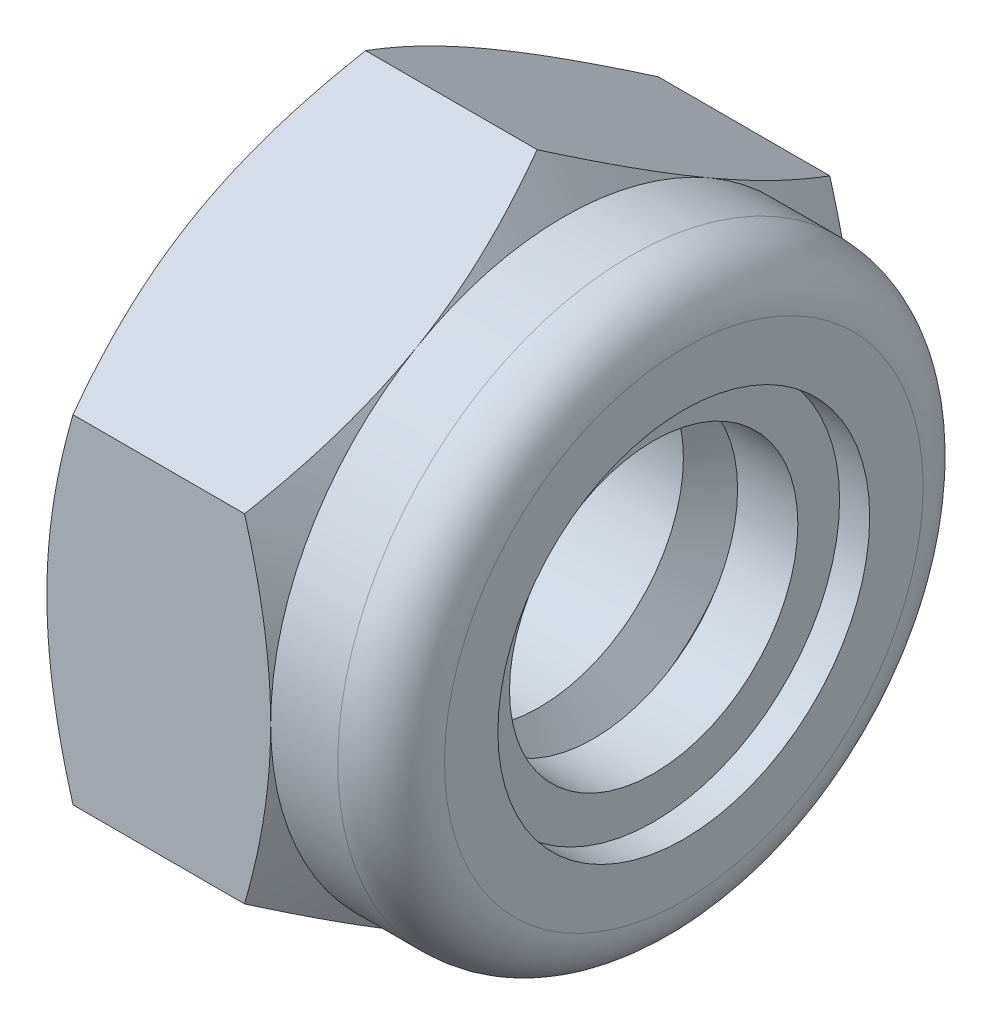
ISO-10303-21;
HEADER;
FILE_DESCRIPTION(('STEP AP214'),'2;1');
FILE_NAME('part.step','',(''),(''),'','','');
FILE_SCHEMA(('AUTOMOTIVE_DESIGN { 1 0 10303 214 1 1 1 1 }'));
ENDSEC;
DATA;
#1=APPLICATION_CONTEXT('core data for automotive mechanical design processes');
#2=APPLICATION_PROTOCOL_DEFINITION('international standard','automotive_design',2000,#1);
#3=PRODUCT_CONTEXT('',#1,'mechanical');
#4=PRODUCT('Part','Part','',(#3));
#5=PRODUCT_RELATED_PRODUCT_CATEGORY('part','',(#4));
#6=PRODUCT_DEFINITION_FORMATION('','',#4);
#7=PRODUCT_DEFINITION_CONTEXT('part definition',#1,'design');
#8=PRODUCT_DEFINITION('design','',#6,#7);
#9=PRODUCT_DEFINITION_SHAPE('','',#8);
#10=(LENGTH_UNIT() NAMED_UNIT(*) SI_UNIT(.MILLI.,.METRE.));
#11=(NAMED_UNIT(*) PLANE_ANGLE_UNIT() SI_UNIT($,.RADIAN.));
#12=(NAMED_UNIT(*) SI_UNIT($,.STERADIAN.) SOLID_ANGLE_UNIT());
#13=UNCERTAINTY_MEASURE_WITH_UNIT(LENGTH_MEASURE(1.E-05),#10,'distance_accuracy_value','');
#14=(GEOMETRIC_REPRESENTATION_CONTEXT(3) GLOBAL_UNCERTAINTY_ASSIGNED_CONTEXT((#13)) GLOBAL_UNIT_ASSIGNED_CONTEXT((#10,
#11,#12)) REPRESENTATION_CONTEXT('',''));
#15=CARTESIAN_POINT('',(0.,0.,0.));
#16=DIRECTION('',(0.,0.,1.));
#17=DIRECTION('',(1.,0.,0.));
#18=AXIS2_PLACEMENT_3D('',#15,#16,#17);
#19=CARTESIAN_POINT('',(6.5,0.,0.));
#20=DIRECTION('',(-1.,0.,0.));
#21=DIRECTION('',(0.,-1.,0.));
#22=AXIS2_PLACEMENT_3D('',#19,#20,#21);
#23=CONICAL_SURFACE('',#22,8.5,1.0471975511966);
#24=CARTESIAN_POINT('',(5.74074395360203,-9.81507004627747,0.0002));
#25=CARTESIAN_POINT('',(5.80301386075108,-9.70719836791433,-0.186639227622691));
#26=CARTESIAN_POINT('',(5.86245770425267,-9.59892450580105,-0.374175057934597));
#27=CARTESIAN_POINT('',(5.97491488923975,-9.3814974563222,-0.750769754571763));
#28=CARTESIAN_POINT('',(6.02792545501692,-9.27234391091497,-0.939829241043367));
#29=CARTESIAN_POINT('',(6.17626661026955,-8.94313560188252,-1.5100347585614));
#30=CARTESIAN_POINT('',(6.26064107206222,-8.72178130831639,-1.89343164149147));
#31=CARTESIAN_POINT('',(6.35957998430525,-8.39052888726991,-2.46717766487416));
#32=CARTESIAN_POINT('',(6.38776480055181,-8.28162036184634,-2.65581276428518));
#33=CARTESIAN_POINT('',(6.4350259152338,-8.06331079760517,-3.03393602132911));
#34=CARTESIAN_POINT('',(6.45410301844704,-7.95390980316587,-3.22342410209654));
#35=CARTESIAN_POINT('',(6.4826652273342,-7.73491944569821,-3.6027265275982));
#36=CARTESIAN_POINT('',(6.49216121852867,-7.62533043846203,-3.79254025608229));
#37=CARTESIAN_POINT('',(6.50135762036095,-7.40605119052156,-4.17234305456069));
#38=CARTESIAN_POINT('',(6.50105833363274,-7.29636095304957,-4.36233211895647));
#39=CARTESIAN_POINT('',(6.49134552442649,-7.09129139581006,-4.71752301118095));
#40=CARTESIAN_POINT('',(6.48311683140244,-6.99589760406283,-4.8827499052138));
#41=CARTESIAN_POINT('',(6.4594107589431,-6.80533344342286,-5.21281671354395));
#42=CARTESIAN_POINT('',(6.4439328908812,-6.71016309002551,-5.37765660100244));
#43=CARTESIAN_POINT('',(6.38699137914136,-6.42502047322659,-5.87153810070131));
#44=CARTESIAN_POINT('',(6.33502693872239,-6.23555293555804,-6.19970550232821));
#45=CARTESIAN_POINT('',(6.20511505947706,-5.8546080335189,-6.85952142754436));
#46=CARTESIAN_POINT('',(6.12661693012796,-5.66317928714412,-7.19108574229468));
#47=CARTESIAN_POINT('',(5.94845866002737,-5.28317649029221,-7.84926989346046));
#48=CARTESIAN_POINT('',(5.84884036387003,-5.09459757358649,-8.17589815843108));
#49=CARTESIAN_POINT('',(5.74074395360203,-4.90736181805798,-8.5002));
#50=B_SPLINE_CURVE_WITH_KNOTS('',3,(#24,#25,#26,#27,#28,#29,#30,#31,#32,#33,#34,#35,#36,#37,#38,
#39,#40,#41,#42,#43,#44,#45,#46,#47,#48,#49),.UNSPECIFIED.,.F.,.F.,(4,2,2,2,2,2,2,2,2,2,2,2,4),
(0.,0.673596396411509,1.34748239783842,2.69805431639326,3.356799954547,4.01548737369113,
4.67342558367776,5.33134346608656,5.9040955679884,6.47688628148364,7.62328361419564,
8.79510569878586,9.9646274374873),.UNSPECIFIED.);
#51=CARTESIAN_POINT('',(6.5,-7.36121593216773,-4.25));
#52=VERTEX_POINT('',#51);
#53=CARTESIAN_POINT('',(5.74081062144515,-4.90747728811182,-8.5));
#54=VERTEX_POINT('',#53);
#55=EDGE_CURVE('E231',#52,#54,#50,.T.);
#56=ORIENTED_EDGE('',*,*,#55,.T.);
#57=CARTESIAN_POINT('',(2.31788839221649,-13.2518632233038,-8.5));
#58=CARTESIAN_POINT('',(2.49854013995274,-12.8800303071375,-8.5));
#59=CARTESIAN_POINT('',(2.67747984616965,-12.5073513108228,-8.5));
#60=CARTESIAN_POINT('',(3.03097371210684,-11.7598514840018,-8.5));
#61=CARTESIAN_POINT('',(3.20552719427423,-11.3850303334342,-8.5));
#62=CARTESIAN_POINT('',(3.55015048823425,-10.6308985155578,-8.5));
#63=CARTESIAN_POINT('',(3.72019131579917,-10.25157455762,-8.5));
#64=CARTESIAN_POINT('',(4.05340731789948,-9.48993414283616,-8.5));
#65=CARTESIAN_POINT('',(4.21658281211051,-9.10761782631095,-8.5));
#66=CARTESIAN_POINT('',(4.53947883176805,-8.32675890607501,-8.5));
#67=CARTESIAN_POINT('',(4.69890971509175,-7.92809587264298,-8.5));
#68=CARTESIAN_POINT('',(5.00587335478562,-7.12613246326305,-8.5));
#69=CARTESIAN_POINT('',(5.15340478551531,-6.72283157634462,-8.5));
#70=CARTESIAN_POINT('',(5.43274708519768,-5.91167859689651,-8.5));
#71=CARTESIAN_POINT('',(5.56458918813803,-5.50383737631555,-8.5));
#72=CARTESIAN_POINT('',(5.80836985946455,-4.68231916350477,-8.5));
#73=CARTESIAN_POINT('',(5.92031462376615,-4.26864403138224,-8.5));
#74=CARTESIAN_POINT('',(6.11836559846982,-3.43747532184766,-8.5));
#75=CARTESIAN_POINT('',(6.2046151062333,-3.02001682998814,-8.5));
#76=CARTESIAN_POINT('',(6.31102233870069,-2.3899721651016,-8.5));
#77=CARTESIAN_POINT('',(6.34266500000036,-2.17929945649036,-8.5));
#78=CARTESIAN_POINT('',(6.3976756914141,-1.75688331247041,-8.5));
#79=CARTESIAN_POINT('',(6.42104452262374,-1.54513998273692,-8.5));
#80=CARTESIAN_POINT('',(6.45874523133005,-1.1236627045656,-8.5));
#81=CARTESIAN_POINT('',(6.47319225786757,-0.913939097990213,-8.5));
#82=CARTESIAN_POINT('',(6.49320090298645,-0.494068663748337,-8.5));
#83=CARTESIAN_POINT('',(6.49876267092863,-0.283921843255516,-8.5));
#84=CARTESIAN_POINT('',(6.50086787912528,0.13641856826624,-8.5));
#85=CARTESIAN_POINT('',(6.49741131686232,0.346612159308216,-8.5));
#86=CARTESIAN_POINT('',(6.48156532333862,0.766664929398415,-8.5));
#87=CARTESIAN_POINT('',(6.46917545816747,0.97652409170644,-8.5));
#88=CARTESIAN_POINT('',(6.42909597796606,1.47878774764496,-8.5));
#89=CARTESIAN_POINT('',(6.39728403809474,1.77087042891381,-8.5));
#90=CARTESIAN_POINT('',(6.31807515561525,2.3528997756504,-8.5));
#91=CARTESIAN_POINT('',(6.27067615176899,2.64284615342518,-8.5));
#92=CARTESIAN_POINT('',(6.1076091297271,3.50913253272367,-8.5));
#93=CARTESIAN_POINT('',(5.9710997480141,4.08160312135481,-8.5));
#94=CARTESIAN_POINT('',(5.73397394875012,4.93766696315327,-8.5));
#95=CARTESIAN_POINT('',(5.64842697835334,5.22569021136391,-8.5));
#96=CARTESIAN_POINT('',(5.46834426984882,5.79894037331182,-8.5));
#97=CARTESIAN_POINT('',(5.3738084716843,6.08416726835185,-8.5));
#98=CARTESIAN_POINT('',(5.17727344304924,6.65191211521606,-8.5));
#99=CARTESIAN_POINT('',(5.07527660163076,6.93443090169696,-8.5));
#100=CARTESIAN_POINT('',(4.86502984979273,7.49712109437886,-8.5));
#101=CARTESIAN_POINT('',(4.75678001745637,7.77729252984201,-8.5));
#102=CARTESIAN_POINT('',(4.49155299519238,8.44510102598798,-8.5));
#103=CARTESIAN_POINT('',(4.33212472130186,8.83176288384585,-8.5));
#104=CARTESIAN_POINT('',(4.00533416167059,9.60172958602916,-8.5));
#105=CARTESIAN_POINT('',(3.83797135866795,9.98503420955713,-8.5));
#106=CARTESIAN_POINT('',(3.49692161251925,10.7489215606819,-8.5));
#107=CARTESIAN_POINT('',(3.32323316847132,11.1295036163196,-8.5));
#108=CARTESIAN_POINT('',(2.97082583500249,11.8883149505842,-8.5));
#109=CARTESIAN_POINT('',(2.79210705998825,12.2665442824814,-8.5));
#110=CARTESIAN_POINT('',(2.4303856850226,13.0214793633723,-8.5));
#111=CARTESIAN_POINT('',(2.24737840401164,13.3981828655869,-8.5));
#112=CARTESIAN_POINT('',(1.87801360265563,14.1499431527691,-8.5));
#113=CARTESIAN_POINT('',(1.69165606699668,14.5249999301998,-8.5));
#114=CARTESIAN_POINT('',(1.12851086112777,15.647996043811,-8.5));
#115=CARTESIAN_POINT('',(0.747599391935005,16.3938671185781,-8.5));
#116=CARTESIAN_POINT('',(0.0110494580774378,17.817867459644,-8.5));
#117=CARTESIAN_POINT('',(-0.343957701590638,18.4963247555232,-8.5));
#118=CARTESIAN_POINT('',(-1.05881736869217,19.8507127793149,-8.5));
#119=CARTESIAN_POINT('',(-1.41867005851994,20.5266434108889,-8.5));
#120=CARTESIAN_POINT('',(-2.1411145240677,21.8747786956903,-8.5));
#121=CARTESIAN_POINT('',(-2.50369676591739,22.5469884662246,-8.5));
#122=CARTESIAN_POINT('',(-3.23174260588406,23.8897963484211,-8.5));
#123=CARTESIAN_POINT('',(-3.59720603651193,24.5603945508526,-8.5));
#124=CARTESIAN_POINT('',(-3.96374232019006,25.2304018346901,-8.5));
#125=B_SPLINE_CURVE_WITH_KNOTS('',3,(#57,#58,#59,#60,#61,#62,#63,#64,#65,#66,#67,#68,#69,#70,
#71,#72,#73,#74,#75,#76,#77,#78,#79,#80,#81,#82,#83,#84,#85,#86,#87,#88,#89,#90,#91,#92,#93,#94,
#95,#96,#97,#98,#99,#100,#101,#102,#103,#104,#105,#106,#107,#108,#109,#110,#111,#112,#113,#114,
#115,#116,#117,#118,#119,#120,#121,#122,#123,#124),.UNSPECIFIED.,.F.,.F.,(4,2,2,2,2,2,2,2,2,2,2,
2,2,2,2,2,2,2,2,2,2,2,2,2,2,2,2,2,2,2,2,2,2,4),(0.,1.24019742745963,2.48058526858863,
3.72760926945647,4.97457513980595,6.26250912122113,7.55058638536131,8.83605488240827,
10.1211223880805,11.3988830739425,12.0378535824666,12.6767622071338,13.3072423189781,
13.9377118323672,14.5681815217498,15.1986818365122,16.0796153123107,16.9606653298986,
18.7237149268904,19.625015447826,20.5263219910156,21.4273411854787,22.3283491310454,
23.5829490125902,24.8376307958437,26.0926122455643,27.3475651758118,28.603958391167,
29.8603573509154,32.3728022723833,34.6699557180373,36.967195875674,39.2584733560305,
41.5496186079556),.UNSPECIFIED.);
#126=CARTESIAN_POINT('',(6.5,0.,-8.5));
#127=VERTEX_POINT('',#126);
#128=EDGE_CURVE('E229',#54,#127,#125,.T.);
#129=ORIENTED_EDGE('',*,*,#128,.T.);
#130=CARTESIAN_POINT('',(6.5,0.,0.));
#131=DIRECTION('',(1.,0.,0.));
#132=DIRECTION('',(0.,1.,0.));
#133=AXIS2_PLACEMENT_3D('',#130,#131,#132);
#134=CIRCLE('',#133,8.5);
#135=EDGE_CURVE('E298',#52,#127,#134,.T.);
#136=ORIENTED_EDGE('',*,*,#135,.F.);
#137=EDGE_LOOP('',(#56,#129,#136));
#138=FACE_BOUND('',#137,.T.);
#139=ADVANCED_FACE('F30',(#138),#23,.T.);
#140=CARTESIAN_POINT('',(6.5,7.36121593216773,-4.25));
#141=VERTEX_POINT('',#140);
#142=EDGE_CURVE('E367',#127,#141,#134,.T.);
#143=ORIENTED_EDGE('',*,*,#142,.F.);
#144=CARTESIAN_POINT('',(5.74081062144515,4.90747728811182,-8.5));
#145=VERTEX_POINT('',#144);
#146=EDGE_CURVE('E223',#127,#145,#125,.T.);
#147=ORIENTED_EDGE('',*,*,#146,.T.);
#148=CARTESIAN_POINT('',(5.74074395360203,4.90736181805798,-8.5002));
#149=CARTESIAN_POINT('',(5.80301386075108,5.01523349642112,-8.31336077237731));
#150=CARTESIAN_POINT('',(5.86245770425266,5.1235073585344,-8.1258249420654));
#151=CARTESIAN_POINT('',(5.97491488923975,5.34093440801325,-7.74923024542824));
#152=CARTESIAN_POINT('',(6.02792545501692,5.45008795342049,-7.56017075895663));
#153=CARTESIAN_POINT('',(6.17626661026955,5.77929626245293,-6.9899652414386));
#154=CARTESIAN_POINT('',(6.26064107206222,6.00065055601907,-6.60656835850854));
#155=CARTESIAN_POINT('',(6.35957998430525,6.33190297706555,-6.03282233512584));
#156=CARTESIAN_POINT('',(6.38776480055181,6.44081150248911,-5.84418723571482));
#157=CARTESIAN_POINT('',(6.4350259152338,6.65912106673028,-5.46606397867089));
#158=CARTESIAN_POINT('',(6.45410301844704,6.76852206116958,-5.27657589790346));
#159=CARTESIAN_POINT('',(6.4826652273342,6.98751241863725,-4.8972734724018));
#160=CARTESIAN_POINT('',(6.49216121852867,7.09710142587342,-4.70745974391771));
#161=CARTESIAN_POINT('',(6.50135762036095,7.3163806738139,-4.32765694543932));
#162=CARTESIAN_POINT('',(6.50105833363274,7.42607091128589,-4.13766788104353));
#163=CARTESIAN_POINT('',(6.4913455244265,7.63114046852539,-3.78247698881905));
#164=CARTESIAN_POINT('',(6.48311683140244,7.72653426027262,-3.6172500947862));
#165=CARTESIAN_POINT('',(6.4594107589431,7.9170984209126,-3.28718328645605));
#166=CARTESIAN_POINT('',(6.4439328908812,8.01226877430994,-3.12234339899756));
#167=CARTESIAN_POINT('',(6.38699137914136,8.29741139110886,-2.62846189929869));
#168=CARTESIAN_POINT('',(6.33502693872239,8.48687892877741,-2.30029449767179));
#169=CARTESIAN_POINT('',(6.20511505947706,8.86782383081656,-1.64047857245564));
#170=CARTESIAN_POINT('',(6.12661693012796,9.05925257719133,-1.30891425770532));
#171=CARTESIAN_POINT('',(5.94845866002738,9.43925537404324,-0.650730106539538));
#172=CARTESIAN_POINT('',(5.84884036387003,9.62783429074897,-0.324101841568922));
#173=CARTESIAN_POINT('',(5.74074395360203,9.81507004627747,0.000199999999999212));
#174=B_SPLINE_CURVE_WITH_KNOTS('',3,(#148,#149,#150,#151,#152,#153,#154,#155,#156,#157,#158,
#159,#160,#161,#162,#163,#164,#165,#166,#167,#168,#169,#170,#171,#172,#173),.UNSPECIFIED.,.F.,
.F.,(4,2,2,2,2,2,2,2,2,2,2,2,4),(0.,0.673596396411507,1.34748239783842,2.69805431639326,
3.356799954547,4.01548737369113,4.67342558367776,5.33134346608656,5.9040955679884,
6.47688628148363,7.62328361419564,8.79510569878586,9.9646274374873),.UNSPECIFIED.);
#175=EDGE_CURVE('E142',#145,#141,#174,.T.);
#176=ORIENTED_EDGE('',*,*,#175,.T.);
#177=EDGE_LOOP('',(#143,#147,#176));
#178=FACE_BOUND('',#177,.T.);
#179=ADVANCED_FACE('F256',(#178),#23,.T.);
#180=CARTESIAN_POINT('',(6.5,7.36121593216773,4.25));
#181=VERTEX_POINT('',#180);
#182=EDGE_CURVE('E302',#141,#181,#134,.T.);
#183=ORIENTED_EDGE('',*,*,#182,.F.);
#184=CARTESIAN_POINT('',(5.74081062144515,9.81495457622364,0.));
#185=VERTEX_POINT('',#184);
#186=EDGE_CURVE('E146',#141,#185,#174,.T.);
#187=ORIENTED_EDGE('',*,*,#186,.T.);
#188=CARTESIAN_POINT('',(5.74074395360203,9.81507004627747,-0.000200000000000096));
#189=CARTESIAN_POINT('',(5.80301386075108,9.70719836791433,0.186639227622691));
#190=CARTESIAN_POINT('',(5.86245770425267,9.59892450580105,0.374175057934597));
#191=CARTESIAN_POINT('',(5.97491488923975,9.3814974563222,0.750769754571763));
#192=CARTESIAN_POINT('',(6.02792545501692,9.27234391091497,0.939829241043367));
#193=CARTESIAN_POINT('',(6.17626661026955,8.94313560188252,1.5100347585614));
#194=CARTESIAN_POINT('',(6.26064107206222,8.72178130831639,1.89343164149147));
#195=CARTESIAN_POINT('',(6.35957998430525,8.39052888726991,2.46717766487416));
#196=CARTESIAN_POINT('',(6.38776480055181,8.28162036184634,2.65581276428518));
#197=CARTESIAN_POINT('',(6.4350259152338,8.06331079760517,3.03393602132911));
#198=CARTESIAN_POINT('',(6.45410301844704,7.95390980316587,3.22342410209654));
#199=CARTESIAN_POINT('',(6.4826652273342,7.73491944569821,3.6027265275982));
#200=CARTESIAN_POINT('',(6.49216121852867,7.62533043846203,3.79254025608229));
#201=CARTESIAN_POINT('',(6.50135762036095,7.40605119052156,4.17234305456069));
#202=CARTESIAN_POINT('',(6.50105833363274,7.29636095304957,4.36233211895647));
#203=CARTESIAN_POINT('',(6.4913455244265,7.09129139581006,4.71752301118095));
#204=CARTESIAN_POINT('',(6.48311683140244,6.99589760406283,4.8827499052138));
#205=CARTESIAN_POINT('',(6.4594107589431,6.80533344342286,5.21281671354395));
#206=CARTESIAN_POINT('',(6.4439328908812,6.71016309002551,5.37765660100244));
#207=CARTESIAN_POINT('',(6.38699137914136,6.42502047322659,5.87153810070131));
#208=CARTESIAN_POINT('',(6.33502693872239,6.23555293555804,6.19970550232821));
#209=CARTESIAN_POINT('',(6.20511505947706,5.8546080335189,6.85952142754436));
#210=CARTESIAN_POINT('',(6.12661693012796,5.66317928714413,7.19108574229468));
#211=CARTESIAN_POINT('',(5.94845866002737,5.28317649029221,7.84926989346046));
#212=CARTESIAN_POINT('',(5.84884036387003,5.09459757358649,8.17589815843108));
#213=CARTESIAN_POINT('',(5.74074395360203,4.90736181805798,8.5002));
#214=B_SPLINE_CURVE_WITH_KNOTS('',3,(#188,#189,#190,#191,#192,#193,#194,#195,#196,#197,#198,
#199,#200,#201,#202,#203,#204,#205,#206,#207,#208,#209,#210,#211,#212,#213),.UNSPECIFIED.,.F.,
.F.,(4,2,2,2,2,2,2,2,2,2,2,2,4),(0.,0.673596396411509,1.34748239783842,2.69805431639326,
3.356799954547,4.01548737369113,4.67342558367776,5.33134346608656,5.9040955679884,
6.47688628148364,7.62328361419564,8.79510569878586,9.9646274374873),.UNSPECIFIED.);
#215=EDGE_CURVE('E141',#185,#181,#214,.T.);
#216=ORIENTED_EDGE('',*,*,#215,.T.);
#217=EDGE_LOOP('',(#183,#187,#216));
#218=FACE_BOUND('',#217,.T.);
#219=ADVANCED_FACE('F261',(#218),#23,.T.);
#220=CARTESIAN_POINT('',(5.74074395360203,-4.90736181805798,8.5002));
#221=CARTESIAN_POINT('',(5.80301386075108,-5.01523349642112,8.31336077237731));
#222=CARTESIAN_POINT('',(5.86245770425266,-5.1235073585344,8.1258249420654));
#223=CARTESIAN_POINT('',(5.97491488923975,-5.34093440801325,7.74923024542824));
#224=CARTESIAN_POINT('',(6.02792545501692,-5.45008795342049,7.56017075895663));
#225=CARTESIAN_POINT('',(6.17626661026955,-5.77929626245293,6.9899652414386));
#226=CARTESIAN_POINT('',(6.26064107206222,-6.00065055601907,6.60656835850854));
#227=CARTESIAN_POINT('',(6.35957998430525,-6.33190297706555,6.03282233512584));
#228=CARTESIAN_POINT('',(6.38776480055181,-6.44081150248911,5.84418723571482));
#229=CARTESIAN_POINT('',(6.4350259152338,-6.65912106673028,5.46606397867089));
#230=CARTESIAN_POINT('',(6.45410301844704,-6.76852206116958,5.27657589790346));
#231=CARTESIAN_POINT('',(6.4826652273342,-6.98751241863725,4.8972734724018));
#232=CARTESIAN_POINT('',(6.49216121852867,-7.09710142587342,4.70745974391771));
#233=CARTESIAN_POINT('',(6.50135762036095,-7.3163806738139,4.32765694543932));
#234=CARTESIAN_POINT('',(6.50105833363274,-7.42607091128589,4.13766788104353));
#235=CARTESIAN_POINT('',(6.4913455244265,-7.63114046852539,3.78247698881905));
#236=CARTESIAN_POINT('',(6.48311683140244,-7.72653426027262,3.6172500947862));
#237=CARTESIAN_POINT('',(6.4594107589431,-7.9170984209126,3.28718328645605));
#238=CARTESIAN_POINT('',(6.4439328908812,-8.01226877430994,3.12234339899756));
#239=CARTESIAN_POINT('',(6.38699137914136,-8.29741139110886,2.62846189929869));
#240=CARTESIAN_POINT('',(6.33502693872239,-8.48687892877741,2.30029449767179));
#241=CARTESIAN_POINT('',(6.20511505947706,-8.86782383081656,1.64047857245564));
#242=CARTESIAN_POINT('',(6.12661693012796,-9.05925257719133,1.30891425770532));
#243=CARTESIAN_POINT('',(5.94845866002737,-9.43925537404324,0.650730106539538));
#244=CARTESIAN_POINT('',(5.84884036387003,-9.62783429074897,0.324101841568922));
#245=CARTESIAN_POINT('',(5.74074395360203,-9.81507004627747,-0.000199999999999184));
#246=B_SPLINE_CURVE_WITH_KNOTS('',3,(#220,#221,#222,#223,#224,#225,#226,#227,#228,#229,#230,
#231,#232,#233,#234,#235,#236,#237,#238,#239,#240,#241,#242,#243,#244,#245),.UNSPECIFIED.,.F.,
.F.,(4,2,2,2,2,2,2,2,2,2,2,2,4),(0.,0.673596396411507,1.34748239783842,2.69805431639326,
3.356799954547,4.01548737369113,4.67342558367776,5.33134346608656,5.9040955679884,
6.47688628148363,7.62328361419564,8.79510569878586,9.9646274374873),.UNSPECIFIED.);
#247=CARTESIAN_POINT('',(6.5,-7.36121593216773,4.25));
#248=VERTEX_POINT('',#247);
#249=CARTESIAN_POINT('',(5.74081062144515,-9.81495457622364,0.));
#250=VERTEX_POINT('',#249);
#251=EDGE_CURVE('E129',#248,#250,#246,.T.);
#252=ORIENTED_EDGE('',*,*,#251,.T.);
#253=EDGE_CURVE('E230',#250,#52,#50,.T.);
#254=ORIENTED_EDGE('',*,*,#253,.T.);
#255=EDGE_CURVE('E295',#248,#52,#134,.T.);
#256=ORIENTED_EDGE('',*,*,#255,.F.);
#257=EDGE_LOOP('',(#252,#254,#256));
#258=FACE_BOUND('',#257,.T.);
#259=ADVANCED_FACE('F268',(#258),#23,.T.);
#260=CARTESIAN_POINT('',(6.5,0.,8.5));
#261=VERTEX_POINT('',#260);
#262=EDGE_CURVE('E140',#181,#261,#134,.T.);
#263=ORIENTED_EDGE('',*,*,#262,.F.);
#264=CARTESIAN_POINT('',(5.74081062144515,4.90747728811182,8.5));
#265=VERTEX_POINT('',#264);
#266=EDGE_CURVE('E134',#181,#265,#214,.T.);
#267=ORIENTED_EDGE('',*,*,#266,.T.);
#268=CARTESIAN_POINT('',(2.31788839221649,-13.2518632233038,8.5));
#269=CARTESIAN_POINT('',(2.49854013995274,-12.8800303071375,8.5));
#270=CARTESIAN_POINT('',(2.67747984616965,-12.5073513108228,8.5));
#271=CARTESIAN_POINT('',(3.03097371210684,-11.7598514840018,8.5));
#272=CARTESIAN_POINT('',(3.20552719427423,-11.3850303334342,8.5));
#273=CARTESIAN_POINT('',(3.55015048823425,-10.6308985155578,8.5));
#274=CARTESIAN_POINT('',(3.72019131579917,-10.25157455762,8.5));
#275=CARTESIAN_POINT('',(4.05340731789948,-9.48993414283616,8.5));
#276=CARTESIAN_POINT('',(4.21658281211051,-9.10761782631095,8.5));
#277=CARTESIAN_POINT('',(4.53947883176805,-8.32675890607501,8.5));
#278=CARTESIAN_POINT('',(4.69890971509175,-7.92809587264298,8.5));
#279=CARTESIAN_POINT('',(5.00587335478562,-7.12613246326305,8.5));
#280=CARTESIAN_POINT('',(5.15340478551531,-6.72283157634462,8.5));
#281=CARTESIAN_POINT('',(5.43274708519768,-5.91167859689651,8.5));
#282=CARTESIAN_POINT('',(5.56458918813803,-5.50383737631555,8.5));
#283=CARTESIAN_POINT('',(5.80836985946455,-4.68231916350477,8.5));
#284=CARTESIAN_POINT('',(5.92031462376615,-4.26864403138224,8.5));
#285=CARTESIAN_POINT('',(6.11836559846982,-3.43747532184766,8.5));
#286=CARTESIAN_POINT('',(6.2046151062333,-3.02001682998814,8.5));
#287=CARTESIAN_POINT('',(6.31102233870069,-2.3899721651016,8.5));
#288=CARTESIAN_POINT('',(6.34266500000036,-2.17929945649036,8.5));
#289=CARTESIAN_POINT('',(6.3976756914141,-1.75688331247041,8.5));
#290=CARTESIAN_POINT('',(6.42104452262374,-1.54513998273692,8.5));
#291=CARTESIAN_POINT('',(6.45874523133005,-1.1236627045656,8.5));
#292=CARTESIAN_POINT('',(6.47319225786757,-0.913939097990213,8.5));
#293=CARTESIAN_POINT('',(6.49320090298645,-0.494068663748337,8.5));
#294=CARTESIAN_POINT('',(6.49876267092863,-0.283921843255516,8.5));
#295=CARTESIAN_POINT('',(6.50086787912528,0.13641856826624,8.5));
#296=CARTESIAN_POINT('',(6.49741131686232,0.346612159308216,8.5));
#297=CARTESIAN_POINT('',(6.48156532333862,0.766664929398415,8.5));
#298=CARTESIAN_POINT('',(6.46917545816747,0.97652409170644,8.5));
#299=CARTESIAN_POINT('',(6.42909597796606,1.47878774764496,8.5));
#300=CARTESIAN_POINT('',(6.39728403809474,1.77087042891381,8.5));
#301=CARTESIAN_POINT('',(6.31807515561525,2.3528997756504,8.5));
#302=CARTESIAN_POINT('',(6.27067615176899,2.64284615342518,8.5));
#303=CARTESIAN_POINT('',(6.1076091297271,3.50913253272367,8.5));
#304=CARTESIAN_POINT('',(5.9710997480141,4.08160312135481,8.5));
#305=CARTESIAN_POINT('',(5.73397394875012,4.93766696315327,8.5));
#306=CARTESIAN_POINT('',(5.64842697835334,5.22569021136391,8.5));
#307=CARTESIAN_POINT('',(5.46834426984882,5.79894037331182,8.5));
#308=CARTESIAN_POINT('',(5.3738084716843,6.08416726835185,8.5));
#309=CARTESIAN_POINT('',(5.17727344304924,6.65191211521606,8.5));
#310=CARTESIAN_POINT('',(5.07527660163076,6.93443090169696,8.5));
#311=CARTESIAN_POINT('',(4.86502984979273,7.49712109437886,8.5));
#312=CARTESIAN_POINT('',(4.75678001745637,7.77729252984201,8.5));
#313=CARTESIAN_POINT('',(4.49155299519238,8.44510102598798,8.5));
#314=CARTESIAN_POINT('',(4.33212472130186,8.83176288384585,8.5));
#315=CARTESIAN_POINT('',(4.00533416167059,9.60172958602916,8.5));
#316=CARTESIAN_POINT('',(3.83797135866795,9.98503420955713,8.5));
#317=CARTESIAN_POINT('',(3.49692161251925,10.7489215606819,8.5));
#318=CARTESIAN_POINT('',(3.32323316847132,11.1295036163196,8.5));
#319=CARTESIAN_POINT('',(2.97082583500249,11.8883149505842,8.5));
#320=CARTESIAN_POINT('',(2.79210705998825,12.2665442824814,8.5));
#321=CARTESIAN_POINT('',(2.4303856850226,13.0214793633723,8.5));
#322=CARTESIAN_POINT('',(2.24737840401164,13.3981828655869,8.5));
#323=CARTESIAN_POINT('',(1.87801360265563,14.1499431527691,8.5));
#324=CARTESIAN_POINT('',(1.69165606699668,14.5249999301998,8.5));
#325=CARTESIAN_POINT('',(1.12851086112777,15.647996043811,8.5));
#326=CARTESIAN_POINT('',(0.747599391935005,16.3938671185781,8.5));
#327=CARTESIAN_POINT('',(0.0110494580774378,17.817867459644,8.5));
#328=CARTESIAN_POINT('',(-0.343957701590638,18.4963247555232,8.5));
#329=CARTESIAN_POINT('',(-1.05881736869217,19.8507127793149,8.5));
#330=CARTESIAN_POINT('',(-1.41867005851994,20.5266434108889,8.5));
#331=CARTESIAN_POINT('',(-2.1411145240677,21.8747786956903,8.5));
#332=CARTESIAN_POINT('',(-2.50369676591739,22.5469884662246,8.5));
#333=CARTESIAN_POINT('',(-3.23174260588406,23.8897963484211,8.5));
#334=CARTESIAN_POINT('',(-3.59720603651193,24.5603945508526,8.5));
#335=CARTESIAN_POINT('',(-3.96374232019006,25.2304018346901,8.5));
#336=B_SPLINE_CURVE_WITH_KNOTS('',3,(#268,#269,#270,#271,#272,#273,#274,#275,#276,#277,#278,
#279,#280,#281,#282,#283,#284,#285,#286,#287,#288,#289,#290,#291,#292,#293,#294,#295,#296,#297,
#298,#299,#300,#301,#302,#303,#304,#305,#306,#307,#308,#309,#310,#311,#312,#313,#314,#315,#316,
#317,#318,#319,#320,#321,#322,#323,#324,#325,#326,#327,#328,#329,#330,#331,#332,#333,#334,#335),
.UNSPECIFIED.,.F.,.F.,(4,2,2,2,2,2,2,2,2,2,2,2,2,2,2,2,2,2,2,2,2,2,2,2,2,2,2,2,2,2,2,2,2,4),(0.,
1.24019742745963,2.48058526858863,3.72760926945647,4.97457513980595,6.26250912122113,
7.55058638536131,8.83605488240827,10.1211223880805,11.3988830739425,12.0378535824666,
12.6767622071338,13.3072423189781,13.9377118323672,14.5681815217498,15.1986818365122,
16.0796153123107,16.9606653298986,18.7237149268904,19.625015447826,20.5263219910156,
21.4273411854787,22.3283491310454,23.5829490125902,24.8376307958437,26.0926122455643,
27.3475651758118,28.603958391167,29.8603573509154,32.3728022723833,34.6699557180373,
36.967195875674,39.2584733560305,41.5496186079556),.UNSPECIFIED.);
#337=EDGE_CURVE('E121',#265,#261,#336,.F.);
#338=ORIENTED_EDGE('',*,*,#337,.T.);
#339=EDGE_LOOP('',(#263,#267,#338));
#340=FACE_BOUND('',#339,.T.);
#341=ADVANCED_FACE('F138',(#340),#23,.T.);
#342=CARTESIAN_POINT('',(5.74081062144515,-4.90747728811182,8.5));
#343=VERTEX_POINT('',#342);
#344=EDGE_CURVE('E124',#261,#343,#336,.F.);
#345=ORIENTED_EDGE('',*,*,#344,.T.);
#346=EDGE_CURVE('E237',#343,#248,#246,.T.);
#347=ORIENTED_EDGE('',*,*,#346,.T.);
#348=EDGE_CURVE('E272',#261,#248,#134,.T.);
#349=ORIENTED_EDGE('',*,*,#348,.F.);
#350=EDGE_LOOP('',(#345,#347,#349));
#351=FACE_BOUND('',#350,.T.);
#352=ADVANCED_FACE('F174',(#351),#23,.T.);
#353=CARTESIAN_POINT('',(2.45373864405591,0.,0.));
#354=DIRECTION('',(1.,0.,0.));
#355=DIRECTION('',(0.,1.,0.));
#356=AXIS2_PLACEMENT_3D('',#353,#354,#355);
#357=CONICAL_SURFACE('',#356,12.75,1.0471975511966);
#358=CARTESIAN_POINT('',(4.18211160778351,-13.2518632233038,8.5));
#359=CARTESIAN_POINT('',(4.00145986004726,-12.8800303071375,8.5));
#360=CARTESIAN_POINT('',(3.82252015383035,-12.5073513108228,8.5));
#361=CARTESIAN_POINT('',(3.46902628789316,-11.7598514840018,8.5));
#362=CARTESIAN_POINT('',(3.29447280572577,-11.3850303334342,8.5));
#363=CARTESIAN_POINT('',(2.94984951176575,-10.6308985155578,8.5));
#364=CARTESIAN_POINT('',(2.77980868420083,-10.25157455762,8.5));
#365=CARTESIAN_POINT('',(2.44659268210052,-9.48993414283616,8.5));
#366=CARTESIAN_POINT('',(2.28341718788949,-9.10761782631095,8.5));
#367=CARTESIAN_POINT('',(1.96052116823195,-8.32675890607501,8.5));
#368=CARTESIAN_POINT('',(1.80109028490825,-7.92809587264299,8.5));
#369=CARTESIAN_POINT('',(1.49412664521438,-7.12613246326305,8.5));
#370=CARTESIAN_POINT('',(1.34659521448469,-6.72283157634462,8.5));
#371=CARTESIAN_POINT('',(1.06725291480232,-5.91167859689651,8.5));
#372=CARTESIAN_POINT('',(0.935410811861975,-5.50383737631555,8.5));
#373=CARTESIAN_POINT('',(0.691630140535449,-4.68231916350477,8.5));
#374=CARTESIAN_POINT('',(0.579685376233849,-4.26864403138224,8.5));
#375=CARTESIAN_POINT('',(0.381634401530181,-3.43747532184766,8.5));
#376=CARTESIAN_POINT('',(0.295384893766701,-3.02001682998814,8.5));
#377=CARTESIAN_POINT('',(0.188977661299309,-2.3899721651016,8.5));
#378=CARTESIAN_POINT('',(0.157334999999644,-2.17929945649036,8.5));
#379=CARTESIAN_POINT('',(0.102324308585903,-1.75688331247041,8.5));
#380=CARTESIAN_POINT('',(0.0789554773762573,-1.54513998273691,8.5));
#381=CARTESIAN_POINT('',(0.041254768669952,-1.1236627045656,8.5));
#382=CARTESIAN_POINT('',(0.0268077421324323,-0.913939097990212,8.5));
#383=CARTESIAN_POINT('',(0.00679909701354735,-0.494068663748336,8.5));
#384=CARTESIAN_POINT('',(0.0012373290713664,-0.283921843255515,8.5));
#385=CARTESIAN_POINT('',(-0.000867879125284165,0.136418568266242,8.5));
#386=CARTESIAN_POINT('',(0.00258868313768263,0.346612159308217,8.5));
#387=CARTESIAN_POINT('',(0.0184346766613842,0.766664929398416,8.5));
#388=CARTESIAN_POINT('',(0.0308245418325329,0.976524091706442,8.5));
#389=CARTESIAN_POINT('',(0.0709040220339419,1.47878774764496,8.5));
#390=CARTESIAN_POINT('',(0.102715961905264,1.77087042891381,8.5));
#391=CARTESIAN_POINT('',(0.181924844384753,2.3528997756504,8.5));
#392=CARTESIAN_POINT('',(0.229323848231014,2.64284615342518,8.5));
#393=CARTESIAN_POINT('',(0.392390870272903,3.50913253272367,8.5));
#394=CARTESIAN_POINT('',(0.528900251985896,4.08160312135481,8.5));
#395=CARTESIAN_POINT('',(0.766026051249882,4.93766696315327,8.5));
#396=CARTESIAN_POINT('',(0.851573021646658,5.22569021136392,8.5));
#397=CARTESIAN_POINT('',(1.03165573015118,5.79894037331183,8.5));
#398=CARTESIAN_POINT('',(1.1261915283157,6.08416726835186,8.5));
#399=CARTESIAN_POINT('',(1.32272655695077,6.65191211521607,8.5));
#400=CARTESIAN_POINT('',(1.42472339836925,6.93443090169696,8.5));
#401=CARTESIAN_POINT('',(1.63497015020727,7.49712109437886,8.5));
#402=CARTESIAN_POINT('',(1.74321998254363,7.77729252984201,8.5));
#403=CARTESIAN_POINT('',(2.00844700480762,8.44510102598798,8.5));
#404=CARTESIAN_POINT('',(2.16787527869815,8.83176288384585,8.5));
#405=CARTESIAN_POINT('',(2.49466583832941,9.60172958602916,8.5));
#406=CARTESIAN_POINT('',(2.66202864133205,9.98503420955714,8.5));
#407=CARTESIAN_POINT('',(3.00307838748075,10.7489215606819,8.5));
#408=CARTESIAN_POINT('',(3.17676683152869,11.1295036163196,8.5));
#409=CARTESIAN_POINT('',(3.52917416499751,11.8883149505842,8.5));
#410=CARTESIAN_POINT('',(3.70789294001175,12.2665442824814,8.5));
#411=CARTESIAN_POINT('',(4.0696143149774,13.0214793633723,8.5));
#412=CARTESIAN_POINT('',(4.25262159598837,13.3981828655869,8.5));
#413=CARTESIAN_POINT('',(4.62198639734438,14.1499431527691,8.5));
#414=CARTESIAN_POINT('',(4.80834393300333,14.5249999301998,8.5));
#415=CARTESIAN_POINT('',(5.37148913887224,15.6479960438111,8.5));
#416=CARTESIAN_POINT('',(5.752400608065,16.3938671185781,8.5));
#417=CARTESIAN_POINT('',(6.48895054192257,17.817867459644,8.5));
#418=CARTESIAN_POINT('',(6.84395770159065,18.4963247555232,8.5));
#419=CARTESIAN_POINT('',(7.55881736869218,19.8507127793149,8.5));
#420=CARTESIAN_POINT('',(7.91867005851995,20.5266434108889,8.5));
#421=CARTESIAN_POINT('',(8.64111452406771,21.8747786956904,8.5));
#422=CARTESIAN_POINT('',(9.0036967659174,22.5469884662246,8.5));
#423=CARTESIAN_POINT('',(9.73174260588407,23.8897963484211,8.5));
#424=CARTESIAN_POINT('',(10.0972060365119,24.5603945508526,8.5));
#425=CARTESIAN_POINT('',(10.4637423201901,25.2304018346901,8.5));
#426=B_SPLINE_CURVE_WITH_KNOTS('',3,(#358,#359,#360,#361,#362,#363,#364,#365,#366,#367,#368,
#369,#370,#371,#372,#373,#374,#375,#376,#377,#378,#379,#380,#381,#382,#383,#384,#385,#386,#387,
#388,#389,#390,#391,#392,#393,#394,#395,#396,#397,#398,#399,#400,#401,#402,#403,#404,#405,#406,
#407,#408,#409,#410,#411,#412,#413,#414,#415,#416,#417,#418,#419,#420,#421,#422,#423,#424,#425),
.UNSPECIFIED.,.F.,.F.,(4,2,2,2,2,2,2,2,2,2,2,2,2,2,2,2,2,2,2,2,2,2,2,2,2,2,2,2,2,2,2,2,2,4),(0.,
1.24019742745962,2.48058526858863,3.72760926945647,4.97457513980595,6.26250912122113,
7.5505863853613,8.83605488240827,10.1211223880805,11.3988830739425,12.0378535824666,
12.6767622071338,13.3072423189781,13.9377118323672,14.5681815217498,15.1986818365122,
16.0796153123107,16.9606653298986,18.7237149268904,19.625015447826,20.5263219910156,
21.4273411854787,22.3283491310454,23.5829490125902,24.8376307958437,26.0926122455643,
27.3475651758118,28.603958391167,29.8603573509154,32.3728022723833,34.6699557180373,
36.967195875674,39.2584733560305,41.5496186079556),.UNSPECIFIED.);
#427=CARTESIAN_POINT('',(0.,0.,8.5));
#428=VERTEX_POINT('',#427);
#429=CARTESIAN_POINT('',(0.759189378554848,4.90747728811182,8.5));
#430=VERTEX_POINT('',#429);
#431=EDGE_CURVE('E180',#428,#430,#426,.T.);
#432=ORIENTED_EDGE('',*,*,#431,.T.);
#433=CARTESIAN_POINT('',(0.759256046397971,4.90736181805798,8.5002));
#434=CARTESIAN_POINT('',(0.696986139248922,5.01523349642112,8.31336077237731));
#435=CARTESIAN_POINT('',(0.637542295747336,5.1235073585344,8.1258249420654));
#436=CARTESIAN_POINT('',(0.525085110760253,5.34093440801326,7.74923024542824));
#437=CARTESIAN_POINT('',(0.472074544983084,5.45008795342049,7.56017075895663));
#438=CARTESIAN_POINT('',(0.323733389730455,5.77929626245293,6.9899652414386));
#439=CARTESIAN_POINT('',(0.239358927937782,6.00065055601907,6.60656835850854));
#440=CARTESIAN_POINT('',(0.140420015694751,6.33190297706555,6.03282233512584));
#441=CARTESIAN_POINT('',(0.112235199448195,6.44081150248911,5.84418723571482));
#442=CARTESIAN_POINT('',(0.0649740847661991,6.65912106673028,5.46606397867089));
#443=CARTESIAN_POINT('',(0.0458969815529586,6.76852206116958,5.27657589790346));
#444=CARTESIAN_POINT('',(0.0173347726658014,6.98751241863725,4.8972734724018));
#445=CARTESIAN_POINT('',(0.00783878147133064,7.09710142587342,4.70745974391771));
#446=CARTESIAN_POINT('',(-0.00135762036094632,7.3163806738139,4.32765694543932));
#447=CARTESIAN_POINT('',(-0.00105833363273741,7.42607091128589,4.13766788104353));
#448=CARTESIAN_POINT('',(0.00865447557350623,7.63114046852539,3.78247698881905));
#449=CARTESIAN_POINT('',(0.016883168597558,7.72653426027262,3.6172500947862));
#450=CARTESIAN_POINT('',(0.0405892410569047,7.9170984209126,3.28718328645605));
#451=CARTESIAN_POINT('',(0.0560671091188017,8.01226877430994,3.12234339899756));
#452=CARTESIAN_POINT('',(0.113008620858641,8.29741139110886,2.62846189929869));
#453=CARTESIAN_POINT('',(0.164973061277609,8.48687892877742,2.30029449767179));
#454=CARTESIAN_POINT('',(0.294884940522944,8.86782383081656,1.64047857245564));
#455=CARTESIAN_POINT('',(0.373383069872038,9.05925257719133,1.30891425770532));
#456=CARTESIAN_POINT('',(0.551541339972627,9.43925537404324,0.650730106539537));
#457=CARTESIAN_POINT('',(0.651159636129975,9.62783429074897,0.32410184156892));
#458=CARTESIAN_POINT('',(0.75925604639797,9.81507004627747,-0.000199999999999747));
#459=B_SPLINE_CURVE_WITH_KNOTS('',3,(#433,#434,#435,#436,#437,#438,#439,#440,#441,#442,#443,
#444,#445,#446,#447,#448,#449,#450,#451,#452,#453,#454,#455,#456,#457,#458),.UNSPECIFIED.,.F.,
.F.,(4,2,2,2,2,2,2,2,2,2,2,2,4),(0.,0.673596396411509,1.34748239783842,2.69805431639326,
3.356799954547,4.01548737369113,4.67342558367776,5.33134346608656,5.9040955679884,
6.47688628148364,7.62328361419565,8.79510569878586,9.9646274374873),.UNSPECIFIED.);
#460=CARTESIAN_POINT('',(0.,7.36121593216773,4.25));
#461=VERTEX_POINT('',#460);
#462=EDGE_CURVE('E11',#430,#461,#459,.T.);
#463=ORIENTED_EDGE('',*,*,#462,.T.);
#464=CARTESIAN_POINT('',(0.,0.,0.));
#465=DIRECTION('',(1.,0.,0.));
#466=DIRECTION('',(0.,1.,0.));
#467=AXIS2_PLACEMENT_3D('',#464,#465,#466);
#468=CIRCLE('',#467,8.5);
#469=EDGE_CURVE('E158',#461,#428,#468,.T.);
#470=ORIENTED_EDGE('',*,*,#469,.T.);
#471=EDGE_LOOP('',(#432,#463,#470));
#472=FACE_BOUND('',#471,.T.);
#473=ADVANCED_FACE('F169',(#472),#357,.T.);
#474=CARTESIAN_POINT('',(0.,7.36121593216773,-4.25));
#475=VERTEX_POINT('',#474);
#476=EDGE_CURVE('E144',#475,#461,#468,.T.);
#477=ORIENTED_EDGE('',*,*,#476,.T.);
#478=CARTESIAN_POINT('',(0.759189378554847,9.81495457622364,0.));
#479=VERTEX_POINT('',#478);
#480=EDGE_CURVE('E34',#461,#479,#459,.T.);
#481=ORIENTED_EDGE('',*,*,#480,.T.);
#482=CARTESIAN_POINT('',(0.75925604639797,9.81507004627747,0.0002));
#483=CARTESIAN_POINT('',(0.696986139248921,9.70719836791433,-0.186639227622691));
#484=CARTESIAN_POINT('',(0.637542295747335,9.59892450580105,-0.374175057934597));
#485=CARTESIAN_POINT('',(0.525085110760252,9.3814974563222,-0.750769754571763));
#486=CARTESIAN_POINT('',(0.472074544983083,9.27234391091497,-0.939829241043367));
#487=CARTESIAN_POINT('',(0.323733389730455,8.94313560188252,-1.5100347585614));
#488=CARTESIAN_POINT('',(0.239358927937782,8.72178130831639,-1.89343164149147));
#489=CARTESIAN_POINT('',(0.140420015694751,8.39052888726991,-2.46717766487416));
#490=CARTESIAN_POINT('',(0.112235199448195,8.28162036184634,-2.65581276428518));
#491=CARTESIAN_POINT('',(0.0649740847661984,8.06331079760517,-3.03393602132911));
#492=CARTESIAN_POINT('',(0.0458969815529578,7.95390980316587,-3.22342410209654));
#493=CARTESIAN_POINT('',(0.0173347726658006,7.73491944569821,-3.6027265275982));
#494=CARTESIAN_POINT('',(0.00783878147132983,7.62533043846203,-3.79254025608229));
#495=CARTESIAN_POINT('',(-0.00135762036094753,7.40605119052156,-4.17234305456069));
#496=CARTESIAN_POINT('',(-0.001058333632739,7.29636095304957,-4.36233211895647));
#497=CARTESIAN_POINT('',(0.00865447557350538,7.09129139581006,-4.71752301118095));
#498=CARTESIAN_POINT('',(0.0168831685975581,6.99589760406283,-4.8827499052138));
#499=CARTESIAN_POINT('',(0.0405892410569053,6.80533344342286,-5.21281671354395));
#500=CARTESIAN_POINT('',(0.056067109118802,6.71016309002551,-5.37765660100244));
#501=CARTESIAN_POINT('',(0.11300862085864,6.42502047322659,-5.87153810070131));
#502=CARTESIAN_POINT('',(0.164973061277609,6.23555293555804,-6.19970550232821));
#503=CARTESIAN_POINT('',(0.294884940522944,5.8546080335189,-6.85952142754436));
#504=CARTESIAN_POINT('',(0.373383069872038,5.66317928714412,-7.19108574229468));
#505=CARTESIAN_POINT('',(0.551541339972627,5.28317649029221,-7.84926989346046));
#506=CARTESIAN_POINT('',(0.651159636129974,5.09459757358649,-8.17589815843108));
#507=CARTESIAN_POINT('',(0.759256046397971,4.90736181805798,-8.5002));
#508=B_SPLINE_CURVE_WITH_KNOTS('',3,(#482,#483,#484,#485,#486,#487,#488,#489,#490,#491,#492,
#493,#494,#495,#496,#497,#498,#499,#500,#501,#502,#503,#504,#505,#506,#507),.UNSPECIFIED.,.F.,
.F.,(4,2,2,2,2,2,2,2,2,2,2,2,4),(0.,0.673596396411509,1.34748239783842,2.69805431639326,
3.356799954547,4.01548737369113,4.67342558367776,5.33134346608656,5.9040955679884,
6.47688628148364,7.62328361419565,8.79510569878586,9.9646274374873),.UNSPECIFIED.);
#509=EDGE_CURVE('E210',#479,#475,#508,.T.);
#510=ORIENTED_EDGE('',*,*,#509,.T.);
#511=EDGE_LOOP('',(#477,#481,#510));
#512=FACE_BOUND('',#511,.T.);
#513=ADVANCED_FACE('F173',(#512),#357,.T.);
#514=CARTESIAN_POINT('',(0.,0.,-8.5));
#515=VERTEX_POINT('',#514);
#516=EDGE_CURVE('E357',#515,#475,#468,.T.);
#517=ORIENTED_EDGE('',*,*,#516,.T.);
#518=CARTESIAN_POINT('',(0.759189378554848,4.90747728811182,-8.5));
#519=VERTEX_POINT('',#518);
#520=EDGE_CURVE('E205',#475,#519,#508,.T.);
#521=ORIENTED_EDGE('',*,*,#520,.T.);
#522=CARTESIAN_POINT('',(4.18211160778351,-13.2518632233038,-8.5));
#523=CARTESIAN_POINT('',(4.00145986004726,-12.8800303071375,-8.5));
#524=CARTESIAN_POINT('',(3.82252015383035,-12.5073513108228,-8.5));
#525=CARTESIAN_POINT('',(3.46902628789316,-11.7598514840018,-8.5));
#526=CARTESIAN_POINT('',(3.29447280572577,-11.3850303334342,-8.5));
#527=CARTESIAN_POINT('',(2.94984951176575,-10.6308985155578,-8.5));
#528=CARTESIAN_POINT('',(2.77980868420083,-10.25157455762,-8.5));
#529=CARTESIAN_POINT('',(2.44659268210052,-9.48993414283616,-8.5));
#530=CARTESIAN_POINT('',(2.28341718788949,-9.10761782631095,-8.5));
#531=CARTESIAN_POINT('',(1.96052116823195,-8.32675890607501,-8.5));
#532=CARTESIAN_POINT('',(1.80109028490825,-7.92809587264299,-8.5));
#533=CARTESIAN_POINT('',(1.49412664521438,-7.12613246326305,-8.5));
#534=CARTESIAN_POINT('',(1.34659521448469,-6.72283157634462,-8.5));
#535=CARTESIAN_POINT('',(1.06725291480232,-5.91167859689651,-8.5));
#536=CARTESIAN_POINT('',(0.935410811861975,-5.50383737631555,-8.5));
#537=CARTESIAN_POINT('',(0.691630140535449,-4.68231916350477,-8.5));
#538=CARTESIAN_POINT('',(0.579685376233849,-4.26864403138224,-8.5));
#539=CARTESIAN_POINT('',(0.381634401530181,-3.43747532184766,-8.5));
#540=CARTESIAN_POINT('',(0.295384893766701,-3.02001682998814,-8.5));
#541=CARTESIAN_POINT('',(0.188977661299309,-2.3899721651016,-8.5));
#542=CARTESIAN_POINT('',(0.157334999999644,-2.17929945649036,-8.5));
#543=CARTESIAN_POINT('',(0.102324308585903,-1.75688331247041,-8.5));
#544=CARTESIAN_POINT('',(0.0789554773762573,-1.54513998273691,-8.5));
#545=CARTESIAN_POINT('',(0.041254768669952,-1.1236627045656,-8.5));
#546=CARTESIAN_POINT('',(0.0268077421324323,-0.913939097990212,-8.5));
#547=CARTESIAN_POINT('',(0.00679909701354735,-0.494068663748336,-8.5));
#548=CARTESIAN_POINT('',(0.0012373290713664,-0.283921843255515,-8.5));
#549=CARTESIAN_POINT('',(-0.000867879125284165,0.136418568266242,-8.5));
#550=CARTESIAN_POINT('',(0.00258868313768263,0.346612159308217,-8.5));
#551=CARTESIAN_POINT('',(0.0184346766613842,0.766664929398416,-8.5));
#552=CARTESIAN_POINT('',(0.0308245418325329,0.976524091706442,-8.5));
#553=CARTESIAN_POINT('',(0.0709040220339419,1.47878774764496,-8.5));
#554=CARTESIAN_POINT('',(0.102715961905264,1.77087042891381,-8.5));
#555=CARTESIAN_POINT('',(0.181924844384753,2.3528997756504,-8.5));
#556=CARTESIAN_POINT('',(0.229323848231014,2.64284615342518,-8.5));
#557=CARTESIAN_POINT('',(0.392390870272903,3.50913253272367,-8.5));
#558=CARTESIAN_POINT('',(0.528900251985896,4.08160312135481,-8.5));
#559=CARTESIAN_POINT('',(0.766026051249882,4.93766696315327,-8.5));
#560=CARTESIAN_POINT('',(0.851573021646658,5.22569021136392,-8.5));
#561=CARTESIAN_POINT('',(1.03165573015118,5.79894037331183,-8.5));
#562=CARTESIAN_POINT('',(1.1261915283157,6.08416726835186,-8.5));
#563=CARTESIAN_POINT('',(1.32272655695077,6.65191211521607,-8.5));
#564=CARTESIAN_POINT('',(1.42472339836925,6.93443090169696,-8.5));
#565=CARTESIAN_POINT('',(1.63497015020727,7.49712109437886,-8.5));
#566=CARTESIAN_POINT('',(1.74321998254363,7.77729252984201,-8.5));
#567=CARTESIAN_POINT('',(2.00844700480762,8.44510102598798,-8.5));
#568=CARTESIAN_POINT('',(2.16787527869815,8.83176288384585,-8.5));
#569=CARTESIAN_POINT('',(2.49466583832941,9.60172958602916,-8.5));
#570=CARTESIAN_POINT('',(2.66202864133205,9.98503420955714,-8.5));
#571=CARTESIAN_POINT('',(3.00307838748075,10.7489215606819,-8.5));
#572=CARTESIAN_POINT('',(3.17676683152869,11.1295036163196,-8.5));
#573=CARTESIAN_POINT('',(3.52917416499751,11.8883149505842,-8.5));
#574=CARTESIAN_POINT('',(3.70789294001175,12.2665442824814,-8.5));
#575=CARTESIAN_POINT('',(4.0696143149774,13.0214793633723,-8.5));
#576=CARTESIAN_POINT('',(4.25262159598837,13.3981828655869,-8.5));
#577=CARTESIAN_POINT('',(4.62198639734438,14.1499431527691,-8.5));
#578=CARTESIAN_POINT('',(4.80834393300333,14.5249999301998,-8.5));
#579=CARTESIAN_POINT('',(5.37148913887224,15.6479960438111,-8.5));
#580=CARTESIAN_POINT('',(5.752400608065,16.3938671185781,-8.5));
#581=CARTESIAN_POINT('',(6.48895054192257,17.817867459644,-8.5));
#582=CARTESIAN_POINT('',(6.84395770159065,18.4963247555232,-8.5));
#583=CARTESIAN_POINT('',(7.55881736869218,19.8507127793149,-8.5));
#584=CARTESIAN_POINT('',(7.91867005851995,20.5266434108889,-8.5));
#585=CARTESIAN_POINT('',(8.64111452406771,21.8747786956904,-8.5));
#586=CARTESIAN_POINT('',(9.0036967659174,22.5469884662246,-8.5));
#587=CARTESIAN_POINT('',(9.73174260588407,23.8897963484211,-8.5));
#588=CARTESIAN_POINT('',(10.0972060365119,24.5603945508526,-8.5));
#589=CARTESIAN_POINT('',(10.4637423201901,25.2304018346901,-8.5));
#590=B_SPLINE_CURVE_WITH_KNOTS('',3,(#522,#523,#524,#525,#526,#527,#528,#529,#530,#531,#532,
#533,#534,#535,#536,#537,#538,#539,#540,#541,#542,#543,#544,#545,#546,#547,#548,#549,#550,#551,
#552,#553,#554,#555,#556,#557,#558,#559,#560,#561,#562,#563,#564,#565,#566,#567,#568,#569,#570,
#571,#572,#573,#574,#575,#576,#577,#578,#579,#580,#581,#582,#583,#584,#585,#586,#587,#588,#589),
.UNSPECIFIED.,.F.,.F.,(4,2,2,2,2,2,2,2,2,2,2,2,2,2,2,2,2,2,2,2,2,2,2,2,2,2,2,2,2,2,2,2,2,4),(0.,
1.24019742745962,2.48058526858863,3.72760926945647,4.97457513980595,6.26250912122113,
7.5505863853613,8.83605488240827,10.1211223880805,11.3988830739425,12.0378535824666,
12.6767622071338,13.3072423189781,13.9377118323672,14.5681815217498,15.1986818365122,
16.0796153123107,16.9606653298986,18.7237149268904,19.625015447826,20.5263219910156,
21.4273411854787,22.3283491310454,23.5829490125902,24.8376307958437,26.0926122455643,
27.3475651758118,28.603958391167,29.8603573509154,32.3728022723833,34.6699557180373,
36.967195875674,39.2584733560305,41.5496186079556),.UNSPECIFIED.);
#591=EDGE_CURVE('E211',#519,#515,#590,.F.);
#592=ORIENTED_EDGE('',*,*,#591,.T.);
#593=EDGE_LOOP('',(#517,#521,#592));
#594=FACE_BOUND('',#593,.T.);
#595=ADVANCED_FACE('F356',(#594),#357,.T.);
#596=CARTESIAN_POINT('',(0.,-7.36121593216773,-4.25));
#597=VERTEX_POINT('',#596);
#598=EDGE_CURVE('E362',#597,#515,#468,.T.);
#599=ORIENTED_EDGE('',*,*,#598,.T.);
#600=CARTESIAN_POINT('',(0.759189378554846,-4.90747728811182,-8.5));
#601=VERTEX_POINT('',#600);
#602=EDGE_CURVE('E200',#515,#601,#590,.F.);
#603=ORIENTED_EDGE('',*,*,#602,.T.);
#604=CARTESIAN_POINT('',(0.759256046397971,-4.90736181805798,-8.5002));
#605=CARTESIAN_POINT('',(0.696986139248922,-5.01523349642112,-8.31336077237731));
#606=CARTESIAN_POINT('',(0.637542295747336,-5.1235073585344,-8.1258249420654));
#607=CARTESIAN_POINT('',(0.525085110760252,-5.34093440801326,-7.74923024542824));
#608=CARTESIAN_POINT('',(0.472074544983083,-5.45008795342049,-7.56017075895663));
#609=CARTESIAN_POINT('',(0.323733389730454,-5.77929626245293,-6.9899652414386));
#610=CARTESIAN_POINT('',(0.239358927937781,-6.00065055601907,-6.60656835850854));
#611=CARTESIAN_POINT('',(0.140420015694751,-6.33190297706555,-6.03282233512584));
#612=CARTESIAN_POINT('',(0.112235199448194,-6.44081150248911,-5.84418723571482));
#613=CARTESIAN_POINT('',(0.0649740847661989,-6.65912106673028,-5.46606397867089));
#614=CARTESIAN_POINT('',(0.0458969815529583,-6.76852206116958,-5.27657589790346));
#615=CARTESIAN_POINT('',(0.0173347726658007,-6.98751241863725,-4.8972734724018));
#616=CARTESIAN_POINT('',(0.00783878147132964,-7.09710142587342,-4.70745974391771));
#617=CARTESIAN_POINT('',(-0.00135762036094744,-7.3163806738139,-4.32765694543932));
#618=CARTESIAN_POINT('',(-0.0010583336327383,-7.42607091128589,-4.13766788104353));
#619=CARTESIAN_POINT('',(0.00865447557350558,-7.63114046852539,-3.78247698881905));
#620=CARTESIAN_POINT('',(0.0168831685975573,-7.72653426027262,-3.6172500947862));
#621=CARTESIAN_POINT('',(0.040589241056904,-7.9170984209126,-3.28718328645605));
#622=CARTESIAN_POINT('',(0.056067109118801,-8.01226877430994,-3.12234339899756));
#623=CARTESIAN_POINT('',(0.11300862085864,-8.29741139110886,-2.62846189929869));
#624=CARTESIAN_POINT('',(0.164973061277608,-8.48687892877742,-2.30029449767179));
#625=CARTESIAN_POINT('',(0.294884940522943,-8.86782383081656,-1.64047857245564));
#626=CARTESIAN_POINT('',(0.373383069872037,-9.05925257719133,-1.30891425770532));
#627=CARTESIAN_POINT('',(0.551541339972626,-9.43925537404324,-0.650730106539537));
#628=CARTESIAN_POINT('',(0.651159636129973,-9.62783429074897,-0.32410184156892));
#629=CARTESIAN_POINT('',(0.759256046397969,-9.81507004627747,0.000199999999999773));
#630=B_SPLINE_CURVE_WITH_KNOTS('',3,(#604,#605,#606,#607,#608,#609,#610,#611,#612,#613,#614,
#615,#616,#617,#618,#619,#620,#621,#622,#623,#624,#625,#626,#627,#628,#629),.UNSPECIFIED.,.F.,
.F.,(4,2,2,2,2,2,2,2,2,2,2,2,4),(0.,0.673596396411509,1.34748239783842,2.69805431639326,
3.356799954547,4.01548737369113,4.67342558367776,5.33134346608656,5.9040955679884,
6.47688628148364,7.62328361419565,8.79510569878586,9.9646274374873),.UNSPECIFIED.);
#631=EDGE_CURVE('E346',#601,#597,#630,.T.);
#632=ORIENTED_EDGE('',*,*,#631,.T.);
#633=EDGE_LOOP('',(#599,#603,#632));
#634=FACE_BOUND('',#633,.T.);
#635=ADVANCED_FACE('F364',(#634),#357,.T.);
#636=CARTESIAN_POINT('',(0.,-7.36121593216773,4.25));
#637=VERTEX_POINT('',#636);
#638=EDGE_CURVE('E365',#637,#597,#468,.T.);
#639=ORIENTED_EDGE('',*,*,#638,.T.);
#640=CARTESIAN_POINT('',(0.759189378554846,-9.81495457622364,0.));
#641=VERTEX_POINT('',#640);
#642=EDGE_CURVE('E194',#597,#641,#630,.T.);
#643=ORIENTED_EDGE('',*,*,#642,.T.);
#644=CARTESIAN_POINT('',(0.759256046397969,-9.81507004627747,-0.0002));
#645=CARTESIAN_POINT('',(0.696986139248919,-9.70719836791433,0.186639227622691));
#646=CARTESIAN_POINT('',(0.637542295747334,-9.59892450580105,0.374175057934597));
#647=CARTESIAN_POINT('',(0.52508511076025,-9.3814974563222,0.750769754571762));
#648=CARTESIAN_POINT('',(0.472074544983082,-9.27234391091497,0.939829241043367));
#649=CARTESIAN_POINT('',(0.323733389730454,-8.94313560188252,1.5100347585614));
#650=CARTESIAN_POINT('',(0.239358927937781,-8.72178130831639,1.89343164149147));
#651=CARTESIAN_POINT('',(0.14042001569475,-8.39052888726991,2.46717766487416));
#652=CARTESIAN_POINT('',(0.112235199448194,-8.28162036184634,2.65581276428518));
#653=CARTESIAN_POINT('',(0.064974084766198,-8.06331079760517,3.03393602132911));
#654=CARTESIAN_POINT('',(0.0458969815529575,-7.95390980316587,3.22342410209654));
#655=CARTESIAN_POINT('',(0.0173347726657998,-7.73491944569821,3.6027265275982));
#656=CARTESIAN_POINT('',(0.0078387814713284,-7.62533043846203,3.79254025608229));
#657=CARTESIAN_POINT('',(-0.0013576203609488,-7.40605119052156,4.17234305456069));
#658=CARTESIAN_POINT('',(-0.0010583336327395,-7.29636095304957,4.36233211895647));
#659=CARTESIAN_POINT('',(0.00865447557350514,-7.09129139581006,4.71752301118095));
#660=CARTESIAN_POINT('',(0.0168831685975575,-6.99589760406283,4.8827499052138));
#661=CARTESIAN_POINT('',(0.0405892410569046,-6.80533344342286,5.21281671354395));
#662=CARTESIAN_POINT('',(0.0560671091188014,-6.71016309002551,5.37765660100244));
#663=CARTESIAN_POINT('',(0.11300862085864,-6.42502047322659,5.87153810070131));
#664=CARTESIAN_POINT('',(0.164973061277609,-6.23555293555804,6.19970550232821));
#665=CARTESIAN_POINT('',(0.294884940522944,-5.8546080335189,6.85952142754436));
#666=CARTESIAN_POINT('',(0.373383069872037,-5.66317928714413,7.19108574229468));
#667=CARTESIAN_POINT('',(0.551541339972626,-5.28317649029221,7.84926989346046));
#668=CARTESIAN_POINT('',(0.651159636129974,-5.09459757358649,8.17589815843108));
#669=CARTESIAN_POINT('',(0.759256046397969,-4.90736181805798,8.5002));
#670=B_SPLINE_CURVE_WITH_KNOTS('',3,(#644,#645,#646,#647,#648,#649,#650,#651,#652,#653,#654,
#655,#656,#657,#658,#659,#660,#661,#662,#663,#664,#665,#666,#667,#668,#669),.UNSPECIFIED.,.F.,
.F.,(4,2,2,2,2,2,2,2,2,2,2,2,4),(0.,0.673596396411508,1.34748239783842,2.69805431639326,
3.356799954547,4.01548737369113,4.67342558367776,5.33134346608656,5.9040955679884,
6.47688628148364,7.62328361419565,8.79510569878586,9.9646274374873),.UNSPECIFIED.);
#671=EDGE_CURVE('E289',#641,#637,#670,.T.);
#672=ORIENTED_EDGE('',*,*,#671,.T.);
#673=EDGE_LOOP('',(#639,#643,#672));
#674=FACE_BOUND('',#673,.T.);
#675=ADVANCED_FACE('F420',(#674),#357,.T.);
#676=EDGE_CURVE('E366',#428,#637,#468,.T.);
#677=ORIENTED_EDGE('',*,*,#676,.T.);
#678=CARTESIAN_POINT('',(0.759189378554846,-4.90747728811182,8.5));
#679=VERTEX_POINT('',#678);
#680=EDGE_CURVE('E188',#637,#679,#670,.T.);
#681=ORIENTED_EDGE('',*,*,#680,.T.);
#682=EDGE_CURVE('E336',#679,#428,#426,.T.);
#683=ORIENTED_EDGE('',*,*,#682,.T.);
#684=EDGE_LOOP('',(#677,#681,#683));
#685=FACE_BOUND('',#684,.T.);
#686=ADVANCED_FACE('F176',(#685),#357,.T.);
#687=CARTESIAN_POINT('',(0.,8.5,0.));
#688=DIRECTION('',(-1.,0.,0.));
#689=DIRECTION('',(0.,-1.,0.));
#690=AXIS2_PLACEMENT_3D('',#687,#688,#689);
#691=PLANE('',#690);
#692=CARTESIAN_POINT('',(0.,0.,0.));
#693=DIRECTION('',(1.,0.,0.));
#694=DIRECTION('',(0.,1.,0.));
#695=AXIS2_PLACEMENT_3D('',#692,#693,#694);
#696=CIRCLE('',#695,5.4);
#697=CARTESIAN_POINT('',(0.,5.4,0.));
#698=VERTEX_POINT('',#697);
#699=EDGE_CURVE('E332',#698,#698,#696,.T.);
#700=ORIENTED_EDGE('',*,*,#699,.T.);
#701=EDGE_LOOP('',(#700));
#702=FACE_BOUND('',#701,.T.);
#703=ORIENTED_EDGE('',*,*,#469,.F.);
#704=ORIENTED_EDGE('',*,*,#476,.F.);
#705=ORIENTED_EDGE('',*,*,#516,.F.);
#706=ORIENTED_EDGE('',*,*,#598,.F.);
#707=ORIENTED_EDGE('',*,*,#638,.F.);
#708=ORIENTED_EDGE('',*,*,#676,.F.);
#709=EDGE_LOOP('',(#703,#704,#705,#706,#707,#708));
#710=FACE_BOUND('',#709,.T.);
#711=ADVANCED_FACE('F32',(#702,#710),#691,.T.);
#712=CARTESIAN_POINT('',(0.,0.,0.));
#713=DIRECTION('',(-1.,0.,0.));
#714=DIRECTION('',(0.,-1.,0.));
#715=AXIS2_PLACEMENT_3D('',#712,#713,#714);
#716=CONICAL_SURFACE('',#715,5.4,1.0471975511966);
#717=CARTESIAN_POINT('',(0.699748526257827,0.,0.));
#718=DIRECTION('',(1.,0.,0.));
#719=DIRECTION('',(0.,1.,0.));
#720=AXIS2_PLACEMENT_3D('',#717,#718,#719);
#721=CIRCLE('',#720,4.188);
#722=CARTESIAN_POINT('',(0.699748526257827,4.188,0.));
#723=VERTEX_POINT('',#722);
#724=EDGE_CURVE('E330',#723,#723,#721,.T.);
#725=ORIENTED_EDGE('',*,*,#724,.T.);
#726=EDGE_LOOP('',(#725));
#727=FACE_BOUND('',#726,.T.);
#728=ORIENTED_EDGE('',*,*,#699,.F.);
#729=EDGE_LOOP('',(#728));
#730=FACE_BOUND('',#729,.T.);
#731=ADVANCED_FACE('F443',(#727,#730),#716,.F.);
#732=CARTESIAN_POINT('',(10.,0.,0.));
#733=DIRECTION('',(1.,0.,0.));
#734=DIRECTION('',(0.,1.,0.));
#735=AXIS2_PLACEMENT_3D('',#732,#733,#734);
#736=CYLINDRICAL_SURFACE('',#735,4.188);
#737=CARTESIAN_POINT('',(5.80025147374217,0.,0.));
#738=DIRECTION('',(1.,0.,0.));
#739=DIRECTION('',(0.,1.,0.));
#740=AXIS2_PLACEMENT_3D('',#737,#738,#739);
#741=CIRCLE('',#740,4.188);
#742=CARTESIAN_POINT('',(5.80025147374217,4.188,0.));
#743=VERTEX_POINT('',#742);
#744=EDGE_CURVE('E327',#743,#743,#741,.T.);
#745=ORIENTED_EDGE('',*,*,#744,.T.);
#746=EDGE_LOOP('',(#745));
#747=FACE_BOUND('',#746,.T.);
#748=ORIENTED_EDGE('',*,*,#724,.F.);
#749=EDGE_LOOP('',(#748));
#750=FACE_BOUND('',#749,.T.);
#751=ADVANCED_FACE('F580',(#747,#750),#736,.F.);
#752=CARTESIAN_POINT('',(5.80025147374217,0.,0.));
#753=DIRECTION('',(1.,0.,0.));
#754=DIRECTION('',(0.,1.,0.));
#755=AXIS2_PLACEMENT_3D('',#752,#753,#754);
#756=CONICAL_SURFACE('',#755,4.188,1.0471975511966);
#757=CARTESIAN_POINT('',(6.5,0.,0.));
#758=DIRECTION('',(1.,0.,0.));
#759=DIRECTION('',(0.,1.,0.));
#760=AXIS2_PLACEMENT_3D('',#757,#758,#759);
#761=CIRCLE('',#760,5.4);
#762=CARTESIAN_POINT('',(6.5,5.4,0.));
#763=VERTEX_POINT('',#762);
#764=EDGE_CURVE('E324',#763,#763,#761,.T.);
#765=ORIENTED_EDGE('',*,*,#764,.T.);
#766=EDGE_LOOP('',(#765));
#767=FACE_BOUND('',#766,.T.);
#768=ORIENTED_EDGE('',*,*,#744,.F.);
#769=EDGE_LOOP('',(#768));
#770=FACE_BOUND('',#769,.T.);
#771=ADVANCED_FACE('F570',(#767,#770),#756,.F.);
#772=CARTESIAN_POINT('',(10.,0.,0.));
#773=DIRECTION('',(1.,0.,0.));
#774=DIRECTION('',(0.,1.,0.));
#775=AXIS2_PLACEMENT_3D('',#772,#773,#774);
#776=CYLINDRICAL_SURFACE('',#775,5.4);
#777=CARTESIAN_POINT('',(7.375,0.,0.));
#778=DIRECTION('',(1.,0.,0.));
#779=DIRECTION('',(0.,1.,0.));
#780=AXIS2_PLACEMENT_3D('',#777,#778,#779);
#781=CIRCLE('',#780,5.4);
#782=CARTESIAN_POINT('',(7.375,5.4,0.));
#783=VERTEX_POINT('',#782);
#784=EDGE_CURVE('E321',#783,#783,#781,.T.);
#785=ORIENTED_EDGE('',*,*,#784,.T.);
#786=EDGE_LOOP('',(#785));
#787=FACE_BOUND('',#786,.T.);
#788=ORIENTED_EDGE('',*,*,#764,.F.);
#789=EDGE_LOOP('',(#788));
#790=FACE_BOUND('',#789,.T.);
#791=ADVANCED_FACE('F560',(#787,#790),#776,.F.);
#792=CARTESIAN_POINT('',(7.375,5.4,0.));
#793=DIRECTION('',(-1.,0.,0.));
#794=DIRECTION('',(0.,-1.,0.));
#795=AXIS2_PLACEMENT_3D('',#792,#793,#794);
#796=PLANE('',#795);
#797=CARTESIAN_POINT('',(7.375,0.,0.));
#798=DIRECTION('',(1.,0.,0.));
#799=DIRECTION('',(0.,1.,0.));
#800=AXIS2_PLACEMENT_3D('',#797,#798,#799);
#801=CIRCLE('',#800,4.188);
#802=CARTESIAN_POINT('',(7.375,4.188,0.));
#803=VERTEX_POINT('',#802);
#804=EDGE_CURVE('E318',#803,#803,#801,.T.);
#805=ORIENTED_EDGE('',*,*,#804,.T.);
#806=EDGE_LOOP('',(#805));
#807=FACE_BOUND('',#806,.T.);
#808=ORIENTED_EDGE('',*,*,#784,.F.);
#809=EDGE_LOOP('',(#808));
#810=FACE_BOUND('',#809,.T.);
#811=ADVANCED_FACE('F550',(#807,#810),#796,.T.);
#812=CARTESIAN_POINT('',(10.,0.,0.));
#813=DIRECTION('',(1.,0.,0.));
#814=DIRECTION('',(0.,1.,0.));
#815=AXIS2_PLACEMENT_3D('',#812,#813,#814);
#816=CYLINDRICAL_SURFACE('',#815,4.188);
#817=CARTESIAN_POINT('',(9.125,0.,0.));
#818=DIRECTION('',(1.,0.,0.));
#819=DIRECTION('',(0.,1.,0.));
#820=AXIS2_PLACEMENT_3D('',#817,#818,#819);
#821=CIRCLE('',#820,4.188);
#822=CARTESIAN_POINT('',(9.125,4.188,0.));
#823=VERTEX_POINT('',#822);
#824=EDGE_CURVE('E315',#823,#823,#821,.T.);
#825=ORIENTED_EDGE('',*,*,#824,.T.);
#826=EDGE_LOOP('',(#825));
#827=FACE_BOUND('',#826,.T.);
#828=ORIENTED_EDGE('',*,*,#804,.F.);
#829=EDGE_LOOP('',(#828));
#830=FACE_BOUND('',#829,.T.);
#831=ADVANCED_FACE('F540',(#827,#830),#816,.F.);
#832=CARTESIAN_POINT('',(9.125,4.188,0.));
#833=DIRECTION('',(1.,0.,0.));
#834=DIRECTION('',(0.,1.,0.));
#835=AXIS2_PLACEMENT_3D('',#832,#833,#834);
#836=PLANE('',#835);
#837=CARTESIAN_POINT('',(9.125,0.,0.));
#838=DIRECTION('',(1.,0.,0.));
#839=DIRECTION('',(0.,1.,0.));
#840=AXIS2_PLACEMENT_3D('',#837,#838,#839);
#841=CIRCLE('',#840,5.4);
#842=CARTESIAN_POINT('',(9.125,5.4,0.));
#843=VERTEX_POINT('',#842);
#844=EDGE_CURVE('E312',#843,#843,#841,.T.);
#845=ORIENTED_EDGE('',*,*,#844,.T.);
#846=EDGE_LOOP('',(#845));
#847=FACE_BOUND('',#846,.T.);
#848=ORIENTED_EDGE('',*,*,#824,.F.);
#849=EDGE_LOOP('',(#848));
#850=FACE_BOUND('',#849,.T.);
#851=ADVANCED_FACE('F530',(#847,#850),#836,.T.);
#852=CARTESIAN_POINT('',(10.,0.,0.));
#853=DIRECTION('',(1.,0.,0.));
#854=DIRECTION('',(0.,1.,0.));
#855=AXIS2_PLACEMENT_3D('',#852,#853,#854);
#856=CYLINDRICAL_SURFACE('',#855,5.4);
#857=CARTESIAN_POINT('',(10.,0.,0.));
#858=DIRECTION('',(1.,0.,0.));
#859=DIRECTION('',(0.,1.,0.));
#860=AXIS2_PLACEMENT_3D('',#857,#858,#859);
#861=CIRCLE('',#860,5.4);
#862=CARTESIAN_POINT('',(10.,5.4,0.));
#863=VERTEX_POINT('',#862);
#864=EDGE_CURVE('E309',#863,#863,#861,.T.);
#865=ORIENTED_EDGE('',*,*,#864,.T.);
#866=EDGE_LOOP('',(#865));
#867=FACE_BOUND('',#866,.T.);
#868=ORIENTED_EDGE('',*,*,#844,.F.);
#869=EDGE_LOOP('',(#868));
#870=FACE_BOUND('',#869,.T.);
#871=ADVANCED_FACE('F520',(#867,#870),#856,.F.);
#872=CARTESIAN_POINT('',(10.,5.4,0.));
#873=DIRECTION('',(1.,0.,0.));
#874=DIRECTION('',(0.,1.,0.));
#875=AXIS2_PLACEMENT_3D('',#872,#873,#874);
#876=PLANE('',#875);
#877=CARTESIAN_POINT('',(10.,0.,0.));
#878=DIRECTION('',(1.,0.,0.));
#879=DIRECTION('',(0.,1.,0.));
#880=AXIS2_PLACEMENT_3D('',#877,#878,#879);
#881=CIRCLE('',#880,6.95);
#882=CARTESIAN_POINT('',(10.,6.95,0.));
#883=VERTEX_POINT('',#882);
#884=EDGE_CURVE('E306',#883,#883,#881,.T.);
#885=ORIENTED_EDGE('',*,*,#884,.T.);
#886=EDGE_LOOP('',(#885));
#887=FACE_BOUND('',#886,.T.);
#888=ORIENTED_EDGE('',*,*,#864,.F.);
#889=EDGE_LOOP('',(#888));
#890=FACE_BOUND('',#889,.T.);
#891=ADVANCED_FACE('F454',(#887,#890),#876,.T.);
#892=CARTESIAN_POINT('',(8.45,0.,0.));
#893=DIRECTION('',(1.,0.,0.));
#894=DIRECTION('',(0.,1.,0.));
#895=AXIS2_PLACEMENT_3D('',#892,#893,#894);
#896=TOROIDAL_SURFACE('',#895,6.95,1.55);
#897=CARTESIAN_POINT('',(8.45,0.,0.));
#898=DIRECTION('',(1.,0.,0.));
#899=DIRECTION('',(0.,1.,0.));
#900=AXIS2_PLACEMENT_3D('',#897,#898,#899);
#901=CIRCLE('',#900,8.5);
#902=CARTESIAN_POINT('',(8.45,8.5,0.));
#903=VERTEX_POINT('',#902);
#904=EDGE_CURVE('E301',#903,#903,#901,.T.);
#905=ORIENTED_EDGE('',*,*,#904,.T.);
#906=EDGE_LOOP('',(#905));
#907=FACE_BOUND('',#906,.T.);
#908=ORIENTED_EDGE('',*,*,#884,.F.);
#909=EDGE_LOOP('',(#908));
#910=FACE_BOUND('',#909,.T.);
#911=ADVANCED_FACE('F449',(#907,#910),#896,.T.);
#912=CARTESIAN_POINT('',(10.,0.,0.));
#913=DIRECTION('',(1.,0.,0.));
#914=DIRECTION('',(0.,1.,0.));
#915=AXIS2_PLACEMENT_3D('',#912,#913,#914);
#916=CYLINDRICAL_SURFACE('',#915,8.5);
#917=ORIENTED_EDGE('',*,*,#182,.T.);
#918=ORIENTED_EDGE('',*,*,#262,.T.);
#919=ORIENTED_EDGE('',*,*,#348,.T.);
#920=ORIENTED_EDGE('',*,*,#255,.T.);
#921=ORIENTED_EDGE('',*,*,#135,.T.);
#922=ORIENTED_EDGE('',*,*,#142,.T.);
#923=EDGE_LOOP('',(#917,#918,#919,#920,#921,#922));
#924=FACE_BOUND('',#923,.T.);
#925=ORIENTED_EDGE('',*,*,#904,.F.);
#926=EDGE_LOOP('',(#925));
#927=FACE_BOUND('',#926,.T.);
#928=ADVANCED_FACE('F166',(#924,#927),#916,.T.);
#929=CARTESIAN_POINT('',(-11.,9.81495457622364,0.));
#930=DIRECTION('',(0.,0.866025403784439,0.5));
#931=DIRECTION('',(0.,-0.5,0.866025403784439));
#932=AXIS2_PLACEMENT_3D('',#929,#930,#931);
#933=PLANE('',#932);
#934=DIRECTION('',(1.,0.,0.));
#935=VECTOR('',#934,1.);
#936=CARTESIAN_POINT('',(-11.,9.81495457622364,0.));
#937=LINE('',#936,#935);
#938=EDGE_CURVE('E273',#479,#185,#937,.T.);
#939=ORIENTED_EDGE('',*,*,#938,.F.);
#940=ORIENTED_EDGE('',*,*,#480,.F.);
#941=ORIENTED_EDGE('',*,*,#462,.F.);
#942=DIRECTION('',(1.,0.,0.));
#943=VECTOR('',#942,1.);
#944=CARTESIAN_POINT('',(-11.,4.90747728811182,8.5));
#945=LINE('',#944,#943);
#946=EDGE_CURVE('E57',#430,#265,#945,.T.);
#947=ORIENTED_EDGE('',*,*,#946,.T.);
#948=ORIENTED_EDGE('',*,*,#266,.F.);
#949=ORIENTED_EDGE('',*,*,#215,.F.);
#950=EDGE_LOOP('',(#939,#940,#941,#947,#948,#949));
#951=FACE_BOUND('',#950,.T.);
#952=ADVANCED_FACE('F133',(#951),#933,.T.);
#953=CARTESIAN_POINT('',(-11.,4.90747728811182,-8.5));
#954=DIRECTION('',(0.,0.866025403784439,-0.5));
#955=DIRECTION('',(0.,0.5,0.866025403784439));
#956=AXIS2_PLACEMENT_3D('',#953,#954,#955);
#957=PLANE('',#956);
#958=DIRECTION('',(1.,0.,0.));
#959=VECTOR('',#958,1.);
#960=CARTESIAN_POINT('',(-11.,4.90747728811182,-8.5));
#961=LINE('',#960,#959);
#962=EDGE_CURVE('E275',#519,#145,#961,.T.);
#963=ORIENTED_EDGE('',*,*,#962,.F.);
#964=ORIENTED_EDGE('',*,*,#520,.F.);
#965=ORIENTED_EDGE('',*,*,#509,.F.);
#966=ORIENTED_EDGE('',*,*,#938,.T.);
#967=ORIENTED_EDGE('',*,*,#186,.F.);
#968=ORIENTED_EDGE('',*,*,#175,.F.);
#969=EDGE_LOOP('',(#963,#964,#965,#966,#967,#968));
#970=FACE_BOUND('',#969,.T.);
#971=ADVANCED_FACE('F165',(#970),#957,.T.);
#972=CARTESIAN_POINT('',(-11.,-4.90747728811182,-8.5));
#973=DIRECTION('',(0.,0.,-1.));
#974=DIRECTION('',(-1.,0.,0.));
#975=AXIS2_PLACEMENT_3D('',#972,#973,#974);
#976=PLANE('',#975);
#977=DIRECTION('',(1.,0.,0.));
#978=VECTOR('',#977,1.);
#979=CARTESIAN_POINT('',(-11.,-4.90747728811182,-8.5));
#980=LINE('',#979,#978);
#981=EDGE_CURVE('E279',#601,#54,#980,.T.);
#982=ORIENTED_EDGE('',*,*,#981,.F.);
#983=ORIENTED_EDGE('',*,*,#602,.F.);
#984=ORIENTED_EDGE('',*,*,#591,.F.);
#985=ORIENTED_EDGE('',*,*,#962,.T.);
#986=ORIENTED_EDGE('',*,*,#146,.F.);
#987=ORIENTED_EDGE('',*,*,#128,.F.);
#988=EDGE_LOOP('',(#982,#983,#984,#985,#986,#987));
#989=FACE_BOUND('',#988,.T.);
#990=ADVANCED_FACE('F214',(#989),#976,.T.);
#991=CARTESIAN_POINT('',(-11.,-9.81495457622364,0.));
#992=DIRECTION('',(0.,-0.866025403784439,-0.5));
#993=DIRECTION('',(0.,0.5,-0.866025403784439));
#994=AXIS2_PLACEMENT_3D('',#991,#992,#993);
#995=PLANE('',#994);
#996=DIRECTION('',(1.,0.,0.));
#997=VECTOR('',#996,1.);
#998=CARTESIAN_POINT('',(-11.,-9.81495457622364,0.));
#999=LINE('',#998,#997);
#1000=EDGE_CURVE('E284',#641,#250,#999,.T.);
#1001=ORIENTED_EDGE('',*,*,#1000,.F.);
#1002=ORIENTED_EDGE('',*,*,#642,.F.);
#1003=ORIENTED_EDGE('',*,*,#631,.F.);
#1004=ORIENTED_EDGE('',*,*,#981,.T.);
#1005=ORIENTED_EDGE('',*,*,#55,.F.);
#1006=ORIENTED_EDGE('',*,*,#253,.F.);
#1007=EDGE_LOOP('',(#1001,#1002,#1003,#1004,#1005,#1006));
#1008=FACE_BOUND('',#1007,.T.);
#1009=ADVANCED_FACE('F219',(#1008),#995,.T.);
#1010=CARTESIAN_POINT('',(-11.,-4.90747728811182,8.5));
#1011=DIRECTION('',(0.,-0.866025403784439,0.5));
#1012=DIRECTION('',(0.,-0.5,-0.866025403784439));
#1013=AXIS2_PLACEMENT_3D('',#1010,#1011,#1012);
#1014=PLANE('',#1013);
#1015=DIRECTION('',(1.,0.,0.));
#1016=VECTOR('',#1015,1.);
#1017=CARTESIAN_POINT('',(-11.,-4.90747728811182,8.5));
#1018=LINE('',#1017,#1016);
#1019=EDGE_CURVE('E50',#679,#343,#1018,.T.);
#1020=ORIENTED_EDGE('',*,*,#1019,.F.);
#1021=ORIENTED_EDGE('',*,*,#680,.F.);
#1022=ORIENTED_EDGE('',*,*,#671,.F.);
#1023=ORIENTED_EDGE('',*,*,#1000,.T.);
#1024=ORIENTED_EDGE('',*,*,#251,.F.);
#1025=ORIENTED_EDGE('',*,*,#346,.F.);
#1026=EDGE_LOOP('',(#1020,#1021,#1022,#1023,#1024,#1025));
#1027=FACE_BOUND('',#1026,.T.);
#1028=ADVANCED_FACE('F245',(#1027),#1014,.T.);
#1029=CARTESIAN_POINT('',(-11.,4.90747728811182,8.5));
#1030=DIRECTION('',(0.,0.,1.));
#1031=DIRECTION('',(1.,0.,0.));
#1032=AXIS2_PLACEMENT_3D('',#1029,#1030,#1031);
#1033=PLANE('',#1032);
#1034=ORIENTED_EDGE('',*,*,#946,.F.);
#1035=ORIENTED_EDGE('',*,*,#431,.F.);
#1036=ORIENTED_EDGE('',*,*,#682,.F.);
#1037=ORIENTED_EDGE('',*,*,#1019,.T.);
#1038=ORIENTED_EDGE('',*,*,#344,.F.);
#1039=ORIENTED_EDGE('',*,*,#337,.F.);
#1040=EDGE_LOOP('',(#1034,#1035,#1036,#1037,#1038,#1039));
#1041=FACE_BOUND('',#1040,.T.);
#1042=ADVANCED_FACE('F122',(#1041),#1033,.T.);
#1043=CLOSED_SHELL('',(#139,#179,#219,#259,#341,#352,#473,#513,#595,#635,#675,#686,#711,#731,
#751,#771,#791,#811,#831,#851,#871,#891,#911,#928,#952,#971,#990,#1009,#1028,#1042));
#1044=MANIFOLD_SOLID_BREP('B2',#1043);
#1045=ADVANCED_BREP_SHAPE_REPRESENTATION('',(#18,#1044),#14);
#1046=SHAPE_DEFINITION_REPRESENTATION(#9,#1045);
ENDSEC;
END-ISO-10303-21;
